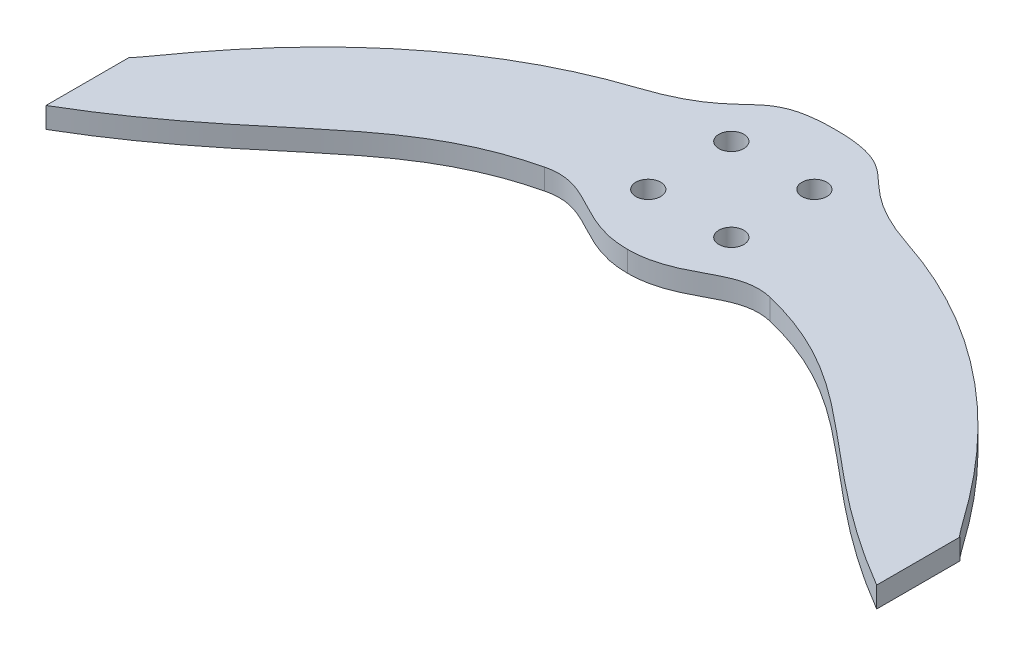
from build123d import *

# Parameters (mm, degrees)
BOSS_EXTRUDE1_DEPTH = 2.5
SKETCH2_R           = 1.5
CUT_EXTRUDE2_DEPTH  = 65.080028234


with BuildPart() as part:
    # Sketch1 → Boss-Extrude1 (new body)
    with BuildSketch(Plane(origin=(0, 0, 0), x_dir=(1, 0, 0), z_dir=(0, 1, 0))):
        with BuildLine():
            Line((-50, -30), (-50, -40))
            add(Edge.make_bspline(
                [(-50, -40), (-28.151112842, -27.210470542), (-26.826457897, -15), (0, -15)],
                knots=[0, 0, 0, 0, 1, 1, 1, 1], degree=3))
            Line((0, -15), (0, 0))
            add(Edge.make_bspline(
                [(0, 0), (-32.734285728, 0), (-48.601729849, -29.181504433), (-50, -30)],
                knots=[0, 0, 0, 0, 1, 1, 1, 1], degree=3))
        make_face()
        with BuildLine():
            add(Edge.make_bspline(
                [(-16.279341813, -2.575204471), (-5.870443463, 0.841962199), (-9.221086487, 5), (0, 5)],
                knots=[0, 0, 0, 0, 1, 1, 1, 1], degree=3))
            add(Edge.make_bspline(
                [(0, 0), (-5.985495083, 0), (-11.407056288, -0.97566808), (-16.279341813, -2.575204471)],
                knots=[0, 0, 0, 0, 0.182850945, 0.182850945, 0.182850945, 0.182850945], degree=3))
            Line((0, 0), (0, 5))
        make_face()
        with BuildLine():
            add(Edge.make_bspline(
                [(-13.584919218, -16.415972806), (-9.852652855, -15.50455805), (-5.453216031, -15), (0, -15)],
                knots=[0.796722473, 0.796722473, 0.796722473, 0.796722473, 1, 1, 1, 1], degree=3))
            add(Edge.make_bspline(
                [(-13.584919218, -16.415972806), (-8.613980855, -15.202075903), (-6.296092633, -20), (0, -20)],
                knots=[0, 0, 0, 0, 1, 1, 1, 1], degree=3))
            Line((0, -20), (0, -15))
        make_face()
    extrude(amount=BOSS_EXTRUDE1_DEPTH)

    # Mirror1: part across plane


with BuildPart() as part_1:
    add(part.part)
    add(part.part.mirror(Plane(origin=(0, 0, 0), x_dir=(0, 0, 1), z_dir=(1, 0, 0))))

    # Sketch2 → Cut-Extrude2 (cut, through all)
    with BuildSketch(Plane(origin=(0, 2.5, 0), x_dir=(1, 0, 0), z_dir=(0, 1, 0))):
        with Locations(Location((-5, -2.5, 0), (0, 0, 270))):
            Circle(SKETCH2_R)
        with Locations(Location((-5, -12.5, 0), (0, 0, 270))):
            Circle(SKETCH2_R)
        with Locations(Location((5, -12.5, 0), (0, 0, 270))):
            Circle(SKETCH2_R)
        with Locations(Location((5, -2.5, 0), (0, 0, 270))):
            Circle(SKETCH2_R)
    extrude(amount=-CUT_EXTRUDE2_DEPTH, mode=Mode.SUBTRACT)


solid = part_1.part
